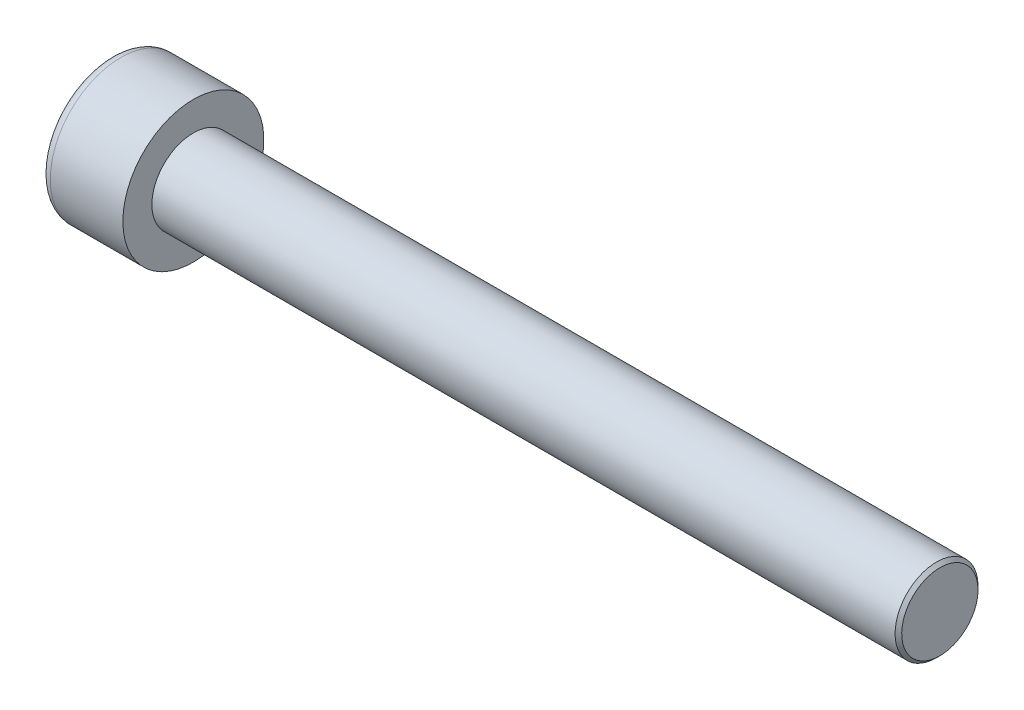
ISO-10303-21;
HEADER;
FILE_DESCRIPTION(('STEP AP214'),'2;1');
FILE_NAME('part.step','',(''),(''),'','','');
FILE_SCHEMA(('AUTOMOTIVE_DESIGN { 1 0 10303 214 1 1 1 1 }'));
ENDSEC;
DATA;
#1=APPLICATION_CONTEXT('core data for automotive mechanical design processes');
#2=APPLICATION_PROTOCOL_DEFINITION('international standard','automotive_design',2000,#1);
#3=PRODUCT_CONTEXT('',#1,'mechanical');
#4=PRODUCT('Part','Part','',(#3));
#5=PRODUCT_RELATED_PRODUCT_CATEGORY('part','',(#4));
#6=PRODUCT_DEFINITION_FORMATION('','',#4);
#7=PRODUCT_DEFINITION_CONTEXT('part definition',#1,'design');
#8=PRODUCT_DEFINITION('design','',#6,#7);
#9=PRODUCT_DEFINITION_SHAPE('','',#8);
#10=(LENGTH_UNIT() NAMED_UNIT(*) SI_UNIT(.MILLI.,.METRE.));
#11=(NAMED_UNIT(*) PLANE_ANGLE_UNIT() SI_UNIT($,.RADIAN.));
#12=(NAMED_UNIT(*) SI_UNIT($,.STERADIAN.) SOLID_ANGLE_UNIT());
#13=UNCERTAINTY_MEASURE_WITH_UNIT(LENGTH_MEASURE(1.E-05),#10,'distance_accuracy_value','');
#14=(GEOMETRIC_REPRESENTATION_CONTEXT(3) GLOBAL_UNCERTAINTY_ASSIGNED_CONTEXT((#13)) GLOBAL_UNIT_ASSIGNED_CONTEXT((#10,
#11,#12)) REPRESENTATION_CONTEXT('',''));
#15=CARTESIAN_POINT('',(0.,0.,0.));
#16=DIRECTION('',(0.,0.,1.));
#17=DIRECTION('',(1.,0.,0.));
#18=AXIS2_PLACEMENT_3D('',#15,#16,#17);
#19=CARTESIAN_POINT('',(2.5,-4.,0.));
#20=DIRECTION('',(-1.,0.,0.));
#21=DIRECTION('',(0.,0.,1.));
#22=AXIS2_PLACEMENT_3D('',#19,#20,#21);
#23=PLANE('',#22);
#24=CARTESIAN_POINT('',(2.49999999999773,0.,0.));
#25=DIRECTION('',(-1.,0.,0.));
#26=DIRECTION('',(0.,0.,1.));
#27=AXIS2_PLACEMENT_3D('',#24,#25,#26);
#28=CIRCLE('',#27,2.00000000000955);
#29=CARTESIAN_POINT('',(2.49999999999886,1.00000000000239,-1.73205080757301));
#30=VERTEX_POINT('',#29);
#31=CARTESIAN_POINT('',(2.49999999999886,2.00000000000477,0.));
#32=VERTEX_POINT('',#31);
#33=EDGE_CURVE('E112',#30,#32,#28,.F.);
#34=ORIENTED_EDGE('',*,*,#33,.T.);
#35=DIRECTION('',(0.,0.,1.));
#36=VECTOR('',#35,1.);
#37=CARTESIAN_POINT('',(2.5,2.,0.));
#38=LINE('',#37,#36);
#39=CARTESIAN_POINT('',(2.5,2.,-1.15470053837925));
#40=VERTEX_POINT('',#39);
#41=EDGE_CURVE('E81',#32,#40,#38,.F.);
#42=ORIENTED_EDGE('',*,*,#41,.T.);
#43=DIRECTION('',(0.,-0.866025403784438,-0.500000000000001));
#44=VECTOR('',#43,1.);
#45=CARTESIAN_POINT('',(2.5,2.,-1.15470053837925));
#46=LINE('',#45,#44);
#47=EDGE_CURVE('E104',#40,#30,#46,.T.);
#48=ORIENTED_EDGE('',*,*,#47,.T.);
#49=EDGE_LOOP('',(#34,#42,#48));
#50=FACE_BOUND('',#49,.T.);
#51=ADVANCED_FACE('F17',(#50),#23,.T.);
#52=CARTESIAN_POINT('',(2.5,-4.,0.));
#53=DIRECTION('',(-1.,0.,0.));
#54=DIRECTION('',(0.,0.,1.));
#55=AXIS2_PLACEMENT_3D('',#52,#53,#54);
#56=PLANE('',#55);
#57=CARTESIAN_POINT('',(2.49999999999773,0.,0.));
#58=DIRECTION('',(-1.,0.,0.));
#59=DIRECTION('',(0.,0.,1.));
#60=AXIS2_PLACEMENT_3D('',#57,#58,#59);
#61=CIRCLE('',#60,2.00000000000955);
#62=CARTESIAN_POINT('',(2.49999999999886,1.00000000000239,1.73205080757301));
#63=VERTEX_POINT('',#62);
#64=EDGE_CURVE('E118',#32,#63,#61,.F.);
#65=ORIENTED_EDGE('',*,*,#64,.T.);
#66=DIRECTION('',(0.,0.866025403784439,-0.5));
#67=VECTOR('',#66,1.);
#68=CARTESIAN_POINT('',(2.5,1.,1.73205080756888));
#69=LINE('',#68,#67);
#70=CARTESIAN_POINT('',(2.5,2.,1.15470053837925));
#71=VERTEX_POINT('',#70);
#72=EDGE_CURVE('E280',#63,#71,#69,.T.);
#73=ORIENTED_EDGE('',*,*,#72,.T.);
#74=DIRECTION('',(0.,0.,1.));
#75=VECTOR('',#74,1.);
#76=CARTESIAN_POINT('',(2.5,2.,0.));
#77=LINE('',#76,#75);
#78=EDGE_CURVE('E285',#71,#32,#77,.F.);
#79=ORIENTED_EDGE('',*,*,#78,.T.);
#80=EDGE_LOOP('',(#65,#73,#79));
#81=FACE_BOUND('',#80,.T.);
#82=ADVANCED_FACE('F325',(#81),#56,.T.);
#83=CARTESIAN_POINT('',(2.5,-4.,0.));
#84=DIRECTION('',(-1.,0.,0.));
#85=DIRECTION('',(0.,0.,1.));
#86=AXIS2_PLACEMENT_3D('',#83,#84,#85);
#87=PLANE('',#86);
#88=CARTESIAN_POINT('',(2.49999999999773,0.,0.));
#89=DIRECTION('',(-1.,0.,0.));
#90=DIRECTION('',(0.,0.,1.));
#91=AXIS2_PLACEMENT_3D('',#88,#89,#90);
#92=CIRCLE('',#91,2.00000000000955);
#93=CARTESIAN_POINT('',(2.49999999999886,-2.00000000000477,0.));
#94=VERTEX_POINT('',#93);
#95=CARTESIAN_POINT('',(2.49999999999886,-1.00000000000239,-1.73205080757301));
#96=VERTEX_POINT('',#95);
#97=EDGE_CURVE('E98',#94,#96,#92,.F.);
#98=ORIENTED_EDGE('',*,*,#97,.T.);
#99=DIRECTION('',(0.,-0.866025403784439,0.499999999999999));
#100=VECTOR('',#99,1.);
#101=CARTESIAN_POINT('',(2.5,-1.,-1.73205080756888));
#102=LINE('',#101,#100);
#103=CARTESIAN_POINT('',(2.5,-2.,-1.15470053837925));
#104=VERTEX_POINT('',#103);
#105=EDGE_CURVE('E119',#96,#104,#102,.T.);
#106=ORIENTED_EDGE('',*,*,#105,.T.);
#107=DIRECTION('',(0.,0.,1.));
#108=VECTOR('',#107,1.);
#109=CARTESIAN_POINT('',(2.5,-2.,0.));
#110=LINE('',#109,#108);
#111=EDGE_CURVE('E124',#104,#94,#110,.T.);
#112=ORIENTED_EDGE('',*,*,#111,.T.);
#113=EDGE_LOOP('',(#98,#106,#112));
#114=FACE_BOUND('',#113,.T.);
#115=ADVANCED_FACE('F336',(#114),#87,.T.);
#116=CARTESIAN_POINT('',(2.49999999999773,0.,0.));
#117=DIRECTION('',(-1.,0.,0.));
#118=DIRECTION('',(0.,0.,1.));
#119=AXIS2_PLACEMENT_3D('',#116,#117,#118);
#120=CONICAL_SURFACE('',#119,2.00000000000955,1.04719755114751);
#121=CARTESIAN_POINT('',(3.65470053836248,0.,0.));
#122=VERTEX_POINT('',#121);
#123=VERTEX_LOOP('',#122);
#124=FACE_BOUND('',#123,.T.);
#125=ORIENTED_EDGE('',*,*,#33,.F.);
#126=CARTESIAN_POINT('',(2.49999999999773,0.,0.));
#127=DIRECTION('',(-1.,0.,0.));
#128=DIRECTION('',(0.,0.,1.));
#129=AXIS2_PLACEMENT_3D('',#126,#127,#128);
#130=CIRCLE('',#129,2.00000000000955);
#131=EDGE_CURVE('E87',#96,#30,#130,.F.);
#132=ORIENTED_EDGE('',*,*,#131,.F.);
#133=ORIENTED_EDGE('',*,*,#97,.F.);
#134=CARTESIAN_POINT('',(2.49999999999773,0.,0.));
#135=DIRECTION('',(-1.,0.,0.));
#136=DIRECTION('',(0.,0.,1.));
#137=AXIS2_PLACEMENT_3D('',#134,#135,#136);
#138=CIRCLE('',#137,2.00000000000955);
#139=CARTESIAN_POINT('',(2.49999999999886,-1.00000000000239,1.73205080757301));
#140=VERTEX_POINT('',#139);
#141=EDGE_CURVE('E97',#140,#94,#138,.F.);
#142=ORIENTED_EDGE('',*,*,#141,.F.);
#143=CARTESIAN_POINT('',(2.49999999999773,0.,0.));
#144=DIRECTION('',(-1.,0.,0.));
#145=DIRECTION('',(0.,0.,1.));
#146=AXIS2_PLACEMENT_3D('',#143,#144,#145);
#147=CIRCLE('',#146,2.00000000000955);
#148=EDGE_CURVE('E121',#63,#140,#147,.F.);
#149=ORIENTED_EDGE('',*,*,#148,.F.);
#150=ORIENTED_EDGE('',*,*,#64,.F.);
#151=EDGE_LOOP('',(#125,#132,#133,#142,#149,#150));
#152=FACE_BOUND('',#151,.T.);
#153=ADVANCED_FACE('F116',(#124,#152),#120,.F.);
#154=CARTESIAN_POINT('',(2.5,-4.,0.));
#155=DIRECTION('',(-1.,0.,0.));
#156=DIRECTION('',(0.,0.,1.));
#157=AXIS2_PLACEMENT_3D('',#154,#155,#156);
#158=PLANE('',#157);
#159=ORIENTED_EDGE('',*,*,#141,.T.);
#160=DIRECTION('',(0.,0.,1.));
#161=VECTOR('',#160,1.);
#162=CARTESIAN_POINT('',(2.5,-2.,1.15470053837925));
#163=LINE('',#162,#161);
#164=CARTESIAN_POINT('',(2.5,-2.,1.15470053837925));
#165=VERTEX_POINT('',#164);
#166=EDGE_CURVE('E235',#165,#94,#163,.F.);
#167=ORIENTED_EDGE('',*,*,#166,.F.);
#168=DIRECTION('',(0.,0.866025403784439,0.5));
#169=VECTOR('',#168,1.);
#170=CARTESIAN_POINT('',(2.5,0.,2.3094010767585));
#171=LINE('',#170,#169);
#172=EDGE_CURVE('E252',#140,#165,#171,.F.);
#173=ORIENTED_EDGE('',*,*,#172,.F.);
#174=EDGE_LOOP('',(#159,#167,#173));
#175=FACE_BOUND('',#174,.T.);
#176=ADVANCED_FACE('F253',(#175),#158,.T.);
#177=CARTESIAN_POINT('',(2.5,-4.,0.));
#178=DIRECTION('',(-1.,0.,0.));
#179=DIRECTION('',(0.,0.,1.));
#180=AXIS2_PLACEMENT_3D('',#177,#178,#179);
#181=PLANE('',#180);
#182=ORIENTED_EDGE('',*,*,#148,.T.);
#183=DIRECTION('',(0.,0.866025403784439,0.5));
#184=VECTOR('',#183,1.);
#185=CARTESIAN_POINT('',(2.5,0.,2.3094010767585));
#186=LINE('',#185,#184);
#187=CARTESIAN_POINT('',(2.5,0.,2.3094010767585));
#188=VERTEX_POINT('',#187);
#189=EDGE_CURVE('E243',#188,#140,#186,.F.);
#190=ORIENTED_EDGE('',*,*,#189,.F.);
#191=DIRECTION('',(0.,0.866025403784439,-0.5));
#192=VECTOR('',#191,1.);
#193=CARTESIAN_POINT('',(2.5,2.,1.15470053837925));
#194=LINE('',#193,#192);
#195=EDGE_CURVE('E246',#63,#188,#194,.F.);
#196=ORIENTED_EDGE('',*,*,#195,.F.);
#197=EDGE_LOOP('',(#182,#190,#196));
#198=FACE_BOUND('',#197,.T.);
#199=ADVANCED_FACE('F241',(#198),#181,.T.);
#200=CARTESIAN_POINT('',(2.5,-4.,0.));
#201=DIRECTION('',(-1.,0.,0.));
#202=DIRECTION('',(0.,0.,1.));
#203=AXIS2_PLACEMENT_3D('',#200,#201,#202);
#204=PLANE('',#203);
#205=ORIENTED_EDGE('',*,*,#131,.T.);
#206=DIRECTION('',(0.,-0.866025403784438,-0.5));
#207=VECTOR('',#206,1.);
#208=CARTESIAN_POINT('',(2.5,0.,-2.3094010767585));
#209=LINE('',#208,#207);
#210=CARTESIAN_POINT('',(2.5,0.,-2.3094010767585));
#211=VERTEX_POINT('',#210);
#212=EDGE_CURVE('E90',#211,#30,#209,.F.);
#213=ORIENTED_EDGE('',*,*,#212,.F.);
#214=DIRECTION('',(0.,-0.866025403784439,0.5));
#215=VECTOR('',#214,1.);
#216=CARTESIAN_POINT('',(2.5,-2.,-1.15470053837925));
#217=LINE('',#216,#215);
#218=EDGE_CURVE('E93',#96,#211,#217,.F.);
#219=ORIENTED_EDGE('',*,*,#218,.F.);
#220=EDGE_LOOP('',(#205,#213,#219));
#221=FACE_BOUND('',#220,.T.);
#222=ADVANCED_FACE('F89',(#221),#204,.T.);
#223=CARTESIAN_POINT('',(2.5,-2.,1.15470053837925));
#224=DIRECTION('',(0.,1.,0.));
#225=DIRECTION('',(0.,0.,1.));
#226=AXIS2_PLACEMENT_3D('',#223,#224,#225);
#227=PLANE('',#226);
#228=ORIENTED_EDGE('',*,*,#111,.F.);
#229=DIRECTION('',(1.,0.,0.));
#230=VECTOR('',#229,1.);
#231=CARTESIAN_POINT('',(2.5,-2.,-1.15470053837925));
#232=LINE('',#231,#230);
#233=CARTESIAN_POINT('',(0.,-2.,-1.15470053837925));
#234=VERTEX_POINT('',#233);
#235=EDGE_CURVE('E296',#234,#104,#232,.T.);
#236=ORIENTED_EDGE('',*,*,#235,.F.);
#237=DIRECTION('',(0.,0.,-1.));
#238=VECTOR('',#237,1.);
#239=CARTESIAN_POINT('',(0.,-2.,0.));
#240=LINE('',#239,#238);
#241=CARTESIAN_POINT('',(0.,-2.,1.15470053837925));
#242=VERTEX_POINT('',#241);
#243=EDGE_CURVE('E155',#234,#242,#240,.F.);
#244=ORIENTED_EDGE('',*,*,#243,.T.);
#245=DIRECTION('',(1.,0.,0.));
#246=VECTOR('',#245,1.);
#247=CARTESIAN_POINT('',(2.5,-2.,1.15470053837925));
#248=LINE('',#247,#246);
#249=EDGE_CURVE('E257',#165,#242,#248,.F.);
#250=ORIENTED_EDGE('',*,*,#249,.F.);
#251=ORIENTED_EDGE('',*,*,#166,.T.);
#252=EDGE_LOOP('',(#228,#236,#244,#250,#251));
#253=FACE_BOUND('',#252,.T.);
#254=ADVANCED_FACE('F319',(#253),#227,.T.);
#255=CARTESIAN_POINT('',(2.5,0.,2.3094010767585));
#256=DIRECTION('',(0.,0.5,-0.866025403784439));
#257=DIRECTION('',(0.,0.866025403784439,0.5));
#258=AXIS2_PLACEMENT_3D('',#255,#256,#257);
#259=PLANE('',#258);
#260=ORIENTED_EDGE('',*,*,#172,.T.);
#261=ORIENTED_EDGE('',*,*,#249,.T.);
#262=DIRECTION('',(0.,0.866025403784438,0.5));
#263=VECTOR('',#262,1.);
#264=CARTESIAN_POINT('',(0.,-2.,1.15470053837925));
#265=LINE('',#264,#263);
#266=CARTESIAN_POINT('',(0.,0.,2.3094010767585));
#267=VERTEX_POINT('',#266);
#268=EDGE_CURVE('E152',#242,#267,#265,.T.);
#269=ORIENTED_EDGE('',*,*,#268,.T.);
#270=DIRECTION('',(1.,0.,0.));
#271=VECTOR('',#270,1.);
#272=CARTESIAN_POINT('',(2.5,0.,2.3094010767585));
#273=LINE('',#272,#271);
#274=EDGE_CURVE('E261',#188,#267,#273,.F.);
#275=ORIENTED_EDGE('',*,*,#274,.F.);
#276=ORIENTED_EDGE('',*,*,#189,.T.);
#277=EDGE_LOOP('',(#260,#261,#269,#275,#276));
#278=FACE_BOUND('',#277,.T.);
#279=ADVANCED_FACE('F259',(#278),#259,.T.);
#280=CARTESIAN_POINT('',(2.5,2.,1.15470053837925));
#281=DIRECTION('',(0.,-0.5,-0.866025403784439));
#282=DIRECTION('',(0.,0.866025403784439,-0.5));
#283=AXIS2_PLACEMENT_3D('',#280,#281,#282);
#284=PLANE('',#283);
#285=ORIENTED_EDGE('',*,*,#195,.T.);
#286=ORIENTED_EDGE('',*,*,#274,.T.);
#287=DIRECTION('',(0.,0.866025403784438,-0.5));
#288=VECTOR('',#287,1.);
#289=CARTESIAN_POINT('',(0.,0.,2.3094010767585));
#290=LINE('',#289,#288);
#291=CARTESIAN_POINT('',(0.,2.,1.15470053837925));
#292=VERTEX_POINT('',#291);
#293=EDGE_CURVE('E149',#267,#292,#290,.T.);
#294=ORIENTED_EDGE('',*,*,#293,.T.);
#295=DIRECTION('',(1.,0.,0.));
#296=VECTOR('',#295,1.);
#297=CARTESIAN_POINT('',(2.5,2.,1.15470053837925));
#298=LINE('',#297,#296);
#299=EDGE_CURVE('E109',#71,#292,#298,.F.);
#300=ORIENTED_EDGE('',*,*,#299,.F.);
#301=ORIENTED_EDGE('',*,*,#72,.F.);
#302=EDGE_LOOP('',(#285,#286,#294,#300,#301));
#303=FACE_BOUND('',#302,.T.);
#304=ADVANCED_FACE('F322',(#303),#284,.T.);
#305=CARTESIAN_POINT('',(2.5,2.,-1.15470053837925));
#306=DIRECTION('',(0.,-1.,0.));
#307=DIRECTION('',(0.,0.,-1.));
#308=AXIS2_PLACEMENT_3D('',#305,#306,#307);
#309=PLANE('',#308);
#310=ORIENTED_EDGE('',*,*,#78,.F.);
#311=ORIENTED_EDGE('',*,*,#299,.T.);
#312=DIRECTION('',(0.,0.,-1.));
#313=VECTOR('',#312,1.);
#314=CARTESIAN_POINT('',(0.,2.,0.));
#315=LINE('',#314,#313);
#316=CARTESIAN_POINT('',(0.,2.,-1.15470053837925));
#317=VERTEX_POINT('',#316);
#318=EDGE_CURVE('E140',#292,#317,#315,.T.);
#319=ORIENTED_EDGE('',*,*,#318,.T.);
#320=DIRECTION('',(1.,0.,0.));
#321=VECTOR('',#320,1.);
#322=CARTESIAN_POINT('',(2.5,2.,-1.15470053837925));
#323=LINE('',#322,#321);
#324=EDGE_CURVE('E108',#40,#317,#323,.F.);
#325=ORIENTED_EDGE('',*,*,#324,.F.);
#326=ORIENTED_EDGE('',*,*,#41,.F.);
#327=EDGE_LOOP('',(#310,#311,#319,#325,#326));
#328=FACE_BOUND('',#327,.T.);
#329=ADVANCED_FACE('F323',(#328),#309,.T.);
#330=CARTESIAN_POINT('',(2.5,0.,-2.3094010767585));
#331=DIRECTION('',(0.,-0.5,0.866025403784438));
#332=DIRECTION('',(0.,-0.866025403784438,-0.5));
#333=AXIS2_PLACEMENT_3D('',#330,#331,#332);
#334=PLANE('',#333);
#335=ORIENTED_EDGE('',*,*,#47,.F.);
#336=ORIENTED_EDGE('',*,*,#324,.T.);
#337=DIRECTION('',(0.,-0.866025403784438,-0.5));
#338=VECTOR('',#337,1.);
#339=CARTESIAN_POINT('',(0.,2.,-1.15470053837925));
#340=LINE('',#339,#338);
#341=CARTESIAN_POINT('',(0.,0.,-2.3094010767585));
#342=VERTEX_POINT('',#341);
#343=EDGE_CURVE('E134',#317,#342,#340,.T.);
#344=ORIENTED_EDGE('',*,*,#343,.T.);
#345=DIRECTION('',(1.,0.,0.));
#346=VECTOR('',#345,1.);
#347=CARTESIAN_POINT('',(2.5,0.,-2.3094010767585));
#348=LINE('',#347,#346);
#349=EDGE_CURVE('E107',#211,#342,#348,.F.);
#350=ORIENTED_EDGE('',*,*,#349,.F.);
#351=ORIENTED_EDGE('',*,*,#212,.T.);
#352=EDGE_LOOP('',(#335,#336,#344,#350,#351));
#353=FACE_BOUND('',#352,.T.);
#354=ADVANCED_FACE('F102',(#353),#334,.T.);
#355=CARTESIAN_POINT('',(2.5,-2.,-1.15470053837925));
#356=DIRECTION('',(0.,0.5,0.866025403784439));
#357=DIRECTION('',(0.,-0.866025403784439,0.5));
#358=AXIS2_PLACEMENT_3D('',#355,#356,#357);
#359=PLANE('',#358);
#360=ORIENTED_EDGE('',*,*,#218,.T.);
#361=ORIENTED_EDGE('',*,*,#349,.T.);
#362=DIRECTION('',(0.,-0.866025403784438,0.5));
#363=VECTOR('',#362,1.);
#364=CARTESIAN_POINT('',(0.,0.,-2.3094010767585));
#365=LINE('',#364,#363);
#366=EDGE_CURVE('E131',#342,#234,#365,.T.);
#367=ORIENTED_EDGE('',*,*,#366,.T.);
#368=ORIENTED_EDGE('',*,*,#235,.T.);
#369=ORIENTED_EDGE('',*,*,#105,.F.);
#370=EDGE_LOOP('',(#360,#361,#367,#368,#369));
#371=FACE_BOUND('',#370,.T.);
#372=ADVANCED_FACE('F191',(#371),#359,.T.);
#373=CARTESIAN_POINT('',(0.,0.,0.));
#374=DIRECTION('',(1.,0.,0.));
#375=DIRECTION('',(0.,0.,-1.));
#376=AXIS2_PLACEMENT_3D('',#373,#374,#375);
#377=PLANE('',#376);
#378=ORIENTED_EDGE('',*,*,#343,.F.);
#379=ORIENTED_EDGE('',*,*,#318,.F.);
#380=ORIENTED_EDGE('',*,*,#293,.F.);
#381=ORIENTED_EDGE('',*,*,#268,.F.);
#382=ORIENTED_EDGE('',*,*,#243,.F.);
#383=ORIENTED_EDGE('',*,*,#366,.F.);
#384=EDGE_LOOP('',(#378,#379,#380,#381,#382,#383));
#385=FACE_BOUND('',#384,.T.);
#386=CARTESIAN_POINT('',(0.,0.,0.));
#387=DIRECTION('',(1.,0.,0.));
#388=DIRECTION('',(0.,0.,-1.));
#389=AXIS2_PLACEMENT_3D('',#386,#387,#388);
#390=CIRCLE('',#389,3.625);
#391=CARTESIAN_POINT('',(0.,0.,-3.625));
#392=VERTEX_POINT('',#391);
#393=CARTESIAN_POINT('',(0.,0.,3.625));
#394=VERTEX_POINT('',#393);
#395=EDGE_CURVE('E129',#392,#394,#390,.T.);
#396=ORIENTED_EDGE('',*,*,#395,.F.);
#397=CARTESIAN_POINT('',(0.,0.,0.));
#398=DIRECTION('',(1.,0.,0.));
#399=DIRECTION('',(0.,0.,1.));
#400=AXIS2_PLACEMENT_3D('',#397,#398,#399);
#401=CIRCLE('',#400,3.625);
#402=EDGE_CURVE('E36',#394,#392,#401,.T.);
#403=ORIENTED_EDGE('',*,*,#402,.F.);
#404=EDGE_LOOP('',(#396,#403));
#405=FACE_BOUND('',#404,.T.);
#406=ADVANCED_FACE('F172',(#385,#405),#377,.F.);
#407=CARTESIAN_POINT('',(0.625,0.,0.));
#408=DIRECTION('',(1.,0.,0.));
#409=DIRECTION('',(0.,0.,-1.));
#410=AXIS2_PLACEMENT_3D('',#407,#408,#409);
#411=TOROIDAL_SURFACE('',#410,3.625,0.625);
#412=CARTESIAN_POINT('',(0.625,0.,0.));
#413=DIRECTION('',(-1.,0.,0.));
#414=DIRECTION('',(0.,0.,1.));
#415=AXIS2_PLACEMENT_3D('',#412,#413,#414);
#416=CIRCLE('',#415,4.25);
#417=CARTESIAN_POINT('',(0.625,0.,4.25));
#418=VERTEX_POINT('',#417);
#419=EDGE_CURVE('E132',#418,#418,#416,.F.);
#420=ORIENTED_EDGE('',*,*,#419,.F.);
#421=EDGE_LOOP('',(#420));
#422=FACE_BOUND('',#421,.T.);
#423=ORIENTED_EDGE('',*,*,#395,.T.);
#424=ORIENTED_EDGE('',*,*,#402,.T.);
#425=EDGE_LOOP('',(#423,#424));
#426=FACE_BOUND('',#425,.T.);
#427=ADVANCED_FACE('F128',(#422,#426),#411,.T.);
#428=CARTESIAN_POINT('',(50.,0.,0.));
#429=DIRECTION('',(1.,0.,0.));
#430=DIRECTION('',(0.,0.,-1.));
#431=AXIS2_PLACEMENT_3D('',#428,#429,#430);
#432=PLANE('',#431);
#433=CARTESIAN_POINT('',(50.0000000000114,0.,0.));
#434=DIRECTION('',(-1.,0.,0.));
#435=DIRECTION('',(0.,-1.,0.));
#436=AXIS2_PLACEMENT_3D('',#433,#434,#435);
#437=CIRCLE('',#436,2.29999999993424);
#438=CARTESIAN_POINT('',(50.0000000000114,-2.29999999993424,0.));
#439=VERTEX_POINT('',#438);
#440=EDGE_CURVE('E227',#439,#439,#437,.T.);
#441=ORIENTED_EDGE('',*,*,#440,.F.);
#442=EDGE_LOOP('',(#441));
#443=FACE_BOUND('',#442,.T.);
#444=ADVANCED_FACE('F171',(#443),#432,.T.);
#445=CARTESIAN_POINT('',(5.,0.,0.));
#446=DIRECTION('',(-1.,0.,0.));
#447=DIRECTION('',(0.,0.,1.));
#448=AXIS2_PLACEMENT_3D('',#445,#446,#447);
#449=CYLINDRICAL_SURFACE('',#448,4.25);
#450=ORIENTED_EDGE('',*,*,#419,.T.);
#451=EDGE_LOOP('',(#450));
#452=FACE_BOUND('',#451,.T.);
#453=CARTESIAN_POINT('',(5.,0.,0.));
#454=DIRECTION('',(-1.,0.,0.));
#455=DIRECTION('',(0.,0.,1.));
#456=AXIS2_PLACEMENT_3D('',#453,#454,#455);
#457=CIRCLE('',#456,4.25);
#458=CARTESIAN_POINT('',(5.,0.,4.25));
#459=VERTEX_POINT('',#458);
#460=EDGE_CURVE('E225',#459,#459,#457,.F.);
#461=ORIENTED_EDGE('',*,*,#460,.F.);
#462=EDGE_LOOP('',(#461));
#463=FACE_BOUND('',#462,.T.);
#464=ADVANCED_FACE('F212',(#452,#463),#449,.T.);
#465=CARTESIAN_POINT('',(49.8000000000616,0.,0.));
#466=DIRECTION('',(-1.,0.,0.));
#467=DIRECTION('',(0.,-1.,0.));
#468=AXIS2_PLACEMENT_3D('',#465,#466,#467);
#469=CONICAL_SURFACE('',#468,2.49999999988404,0.785398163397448);
#470=CARTESIAN_POINT('',(49.8,0.,0.));
#471=DIRECTION('',(-1.,0.,0.));
#472=DIRECTION('',(0.,0.,1.));
#473=AXIS2_PLACEMENT_3D('',#470,#471,#472);
#474=CIRCLE('',#473,2.5);
#475=CARTESIAN_POINT('',(49.8,0.,2.5));
#476=VERTEX_POINT('',#475);
#477=EDGE_CURVE('E28',#476,#476,#474,.T.);
#478=ORIENTED_EDGE('',*,*,#477,.F.);
#479=EDGE_LOOP('',(#478));
#480=FACE_BOUND('',#479,.T.);
#481=ORIENTED_EDGE('',*,*,#440,.T.);
#482=EDGE_LOOP('',(#481));
#483=FACE_BOUND('',#482,.T.);
#484=ADVANCED_FACE('F206',(#480,#483),#469,.T.);
#485=CARTESIAN_POINT('',(5.,0.,0.));
#486=DIRECTION('',(1.,0.,0.));
#487=DIRECTION('',(0.,0.,-1.));
#488=AXIS2_PLACEMENT_3D('',#485,#486,#487);
#489=PLANE('',#488);
#490=CARTESIAN_POINT('',(5.,0.,0.));
#491=DIRECTION('',(-1.,0.,0.));
#492=DIRECTION('',(0.,0.,1.));
#493=AXIS2_PLACEMENT_3D('',#490,#491,#492);
#494=CIRCLE('',#493,2.5);
#495=CARTESIAN_POINT('',(5.,0.,2.5));
#496=VERTEX_POINT('',#495);
#497=EDGE_CURVE('E11',#496,#496,#494,.F.);
#498=ORIENTED_EDGE('',*,*,#497,.F.);
#499=EDGE_LOOP('',(#498));
#500=FACE_BOUND('',#499,.T.);
#501=ORIENTED_EDGE('',*,*,#460,.T.);
#502=EDGE_LOOP('',(#501));
#503=FACE_BOUND('',#502,.T.);
#504=ADVANCED_FACE('F200',(#500,#503),#489,.T.);
#505=CARTESIAN_POINT('',(50.,0.,0.));
#506=DIRECTION('',(-1.,0.,0.));
#507=DIRECTION('',(0.,0.,1.));
#508=AXIS2_PLACEMENT_3D('',#505,#506,#507);
#509=CYLINDRICAL_SURFACE('',#508,2.5);
#510=ORIENTED_EDGE('',*,*,#497,.T.);
#511=EDGE_LOOP('',(#510));
#512=FACE_BOUND('',#511,.T.);
#513=ORIENTED_EDGE('',*,*,#477,.T.);
#514=EDGE_LOOP('',(#513));
#515=FACE_BOUND('',#514,.T.);
#516=ADVANCED_FACE('F198',(#512,#515),#509,.T.);
#517=CLOSED_SHELL('',(#51,#82,#115,#153,#176,#199,#222,#254,#279,#304,#329,#354,#372,#406,#427,
#444,#464,#484,#504,#516));
#518=MANIFOLD_SOLID_BREP('B1',#517);
#519=ADVANCED_BREP_SHAPE_REPRESENTATION('',(#18,#518),#14);
#520=SHAPE_DEFINITION_REPRESENTATION(#9,#519);
ENDSEC;
END-ISO-10303-21;
